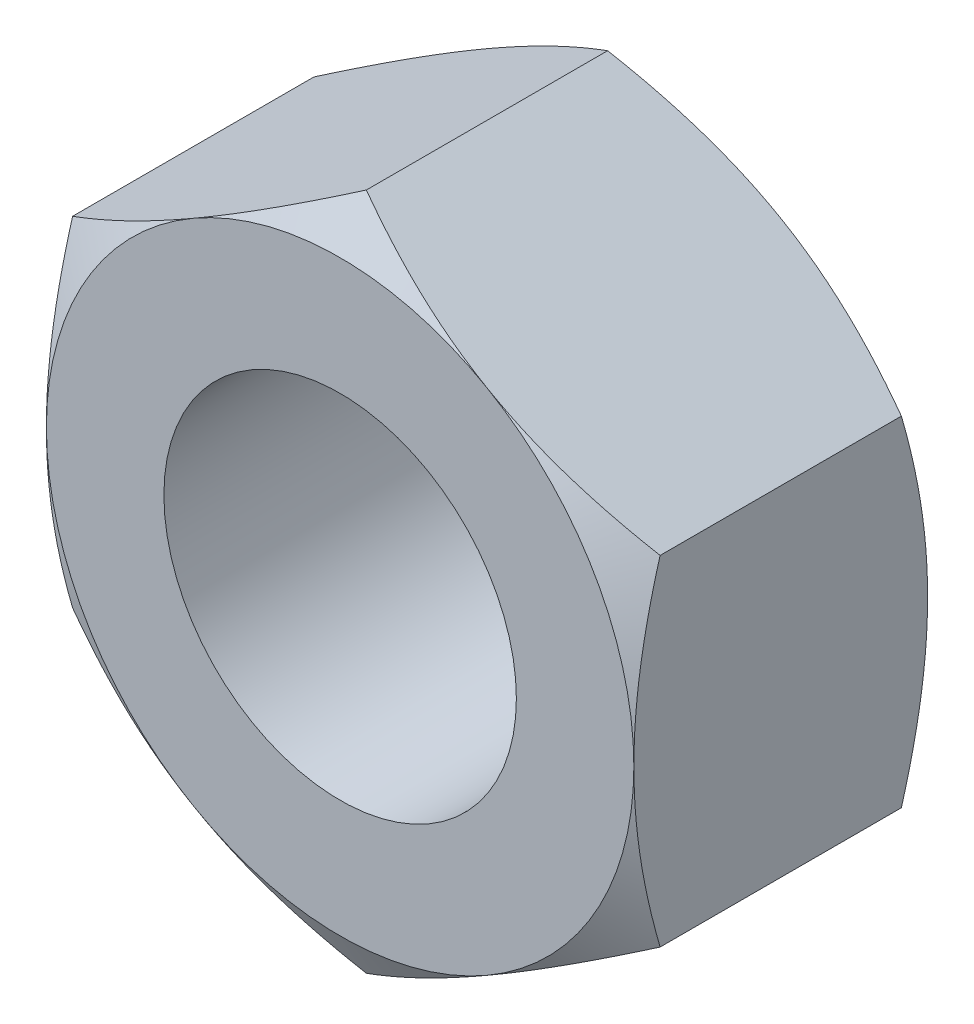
from build123d import *

# Parameters (mm, degrees)
BASE_EXTRUSION_DEPTH    = 5
ESQUISSE3_R             = 3
ENL_V_MAT_EXTRU_1_DEPTH = 10.128709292


with BuildPart() as part:
    # Esquisse1 → Base-Extrusion (new body)
    with BuildSketch(Plane.XY):
        Polygon((5, -2.886751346), (5, 2.886751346), (0, 5.773502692), (-5, 2.886751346), (-5, -2.886751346), (0, -5.773502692), align=None)
    extrude(amount=-BASE_EXTRUSION_DEPTH)

    # Esquisse2 → Enl_vement de mati_re-R_volution1 (revolve, cut)
    with BuildSketch(Plane(origin=(0, 0, 0), x_dir=(1, 0, 0), z_dir=(0, 1, 0))):
        Polygon((-5, 0), (-10.330127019, 0), (-10.330127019, 5), (-5, 5), (-9.330127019, 2.5), align=None)
    revolve(axis=Axis((0, 0, -5), (0, 0, 1)), mode=Mode.SUBTRACT)

    # Esquisse3 → Enl_v. mat.-Extru.1 (cut, through all)
    with BuildSketch(Plane.XY):
        Circle(ESQUISSE3_R)
    extrude(amount=-ENL_V_MAT_EXTRU_1_DEPTH, mode=Mode.SUBTRACT)


solid = part.part
